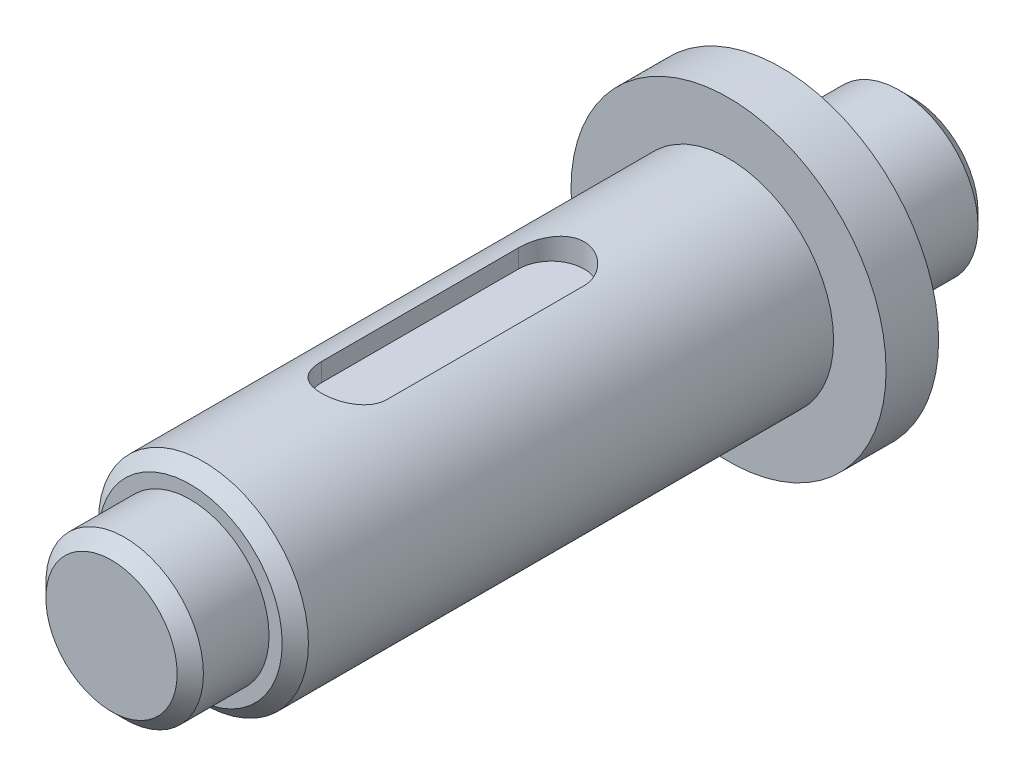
ISO-10303-21;
HEADER;
FILE_DESCRIPTION(('STEP AP214'),'2;1');
FILE_NAME('part.step','',(''),(''),'','','');
FILE_SCHEMA(('AUTOMOTIVE_DESIGN { 1 0 10303 214 1 1 1 1 }'));
ENDSEC;
DATA;
#1=APPLICATION_CONTEXT('core data for automotive mechanical design processes');
#2=APPLICATION_PROTOCOL_DEFINITION('international standard','automotive_design',2000,#1);
#3=PRODUCT_CONTEXT('',#1,'mechanical');
#4=PRODUCT('Part','Part','',(#3));
#5=PRODUCT_RELATED_PRODUCT_CATEGORY('part','',(#4));
#6=PRODUCT_DEFINITION_FORMATION('','',#4);
#7=PRODUCT_DEFINITION_CONTEXT('part definition',#1,'design');
#8=PRODUCT_DEFINITION('design','',#6,#7);
#9=PRODUCT_DEFINITION_SHAPE('','',#8);
#10=(LENGTH_UNIT() NAMED_UNIT(*) SI_UNIT(.MILLI.,.METRE.));
#11=(NAMED_UNIT(*) PLANE_ANGLE_UNIT() SI_UNIT($,.RADIAN.));
#12=(NAMED_UNIT(*) SI_UNIT($,.STERADIAN.) SOLID_ANGLE_UNIT());
#13=UNCERTAINTY_MEASURE_WITH_UNIT(LENGTH_MEASURE(1.E-05),#10,'distance_accuracy_value','');
#14=(GEOMETRIC_REPRESENTATION_CONTEXT(3) GLOBAL_UNCERTAINTY_ASSIGNED_CONTEXT((#13)) GLOBAL_UNIT_ASSIGNED_CONTEXT((#10,
#11,#12)) REPRESENTATION_CONTEXT('',''));
#15=CARTESIAN_POINT('',(0.,0.,0.));
#16=DIRECTION('',(0.,0.,1.));
#17=DIRECTION('',(1.,0.,0.));
#18=AXIS2_PLACEMENT_3D('',#15,#16,#17);
#19=CARTESIAN_POINT('',(0.,0.,55.));
#20=DIRECTION('',(0.,0.,-1.));
#21=DIRECTION('',(-1.,0.,0.));
#22=AXIS2_PLACEMENT_3D('',#19,#20,#21);
#23=CYLINDRICAL_SURFACE('',#22,8.);
#24=CARTESIAN_POINT('',(0.,0.,54.));
#25=DIRECTION('',(0.,0.,1.));
#26=DIRECTION('',(1.,0.,0.));
#27=AXIS2_PLACEMENT_3D('',#24,#25,#26);
#28=CIRCLE('',#27,8.);
#29=CARTESIAN_POINT('',(8.,0.,54.));
#30=VERTEX_POINT('',#29);
#31=EDGE_CURVE('E131',#30,#30,#28,.F.);
#32=ORIENTED_EDGE('',*,*,#31,.T.);
#33=EDGE_LOOP('',(#32));
#34=FACE_BOUND('',#33,.T.);
#35=CARTESIAN_POINT('',(0.,0.,14.));
#36=DIRECTION('',(0.,0.,1.));
#37=DIRECTION('',(1.,0.,0.));
#38=AXIS2_PLACEMENT_3D('',#35,#36,#37);
#39=CIRCLE('',#38,8.);
#40=CARTESIAN_POINT('',(8.,0.,14.));
#41=VERTEX_POINT('',#40);
#42=EDGE_CURVE('E115',#41,#41,#39,.T.);
#43=ORIENTED_EDGE('',*,*,#42,.T.);
#44=EDGE_LOOP('',(#43));
#45=FACE_BOUND('',#44,.T.);
#46=CARTESIAN_POINT('',(2.5,7.59934207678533,27.5));
#47=CARTESIAN_POINT('',(2.5000087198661,7.59933203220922,27.4315339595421));
#48=CARTESIAN_POINT('',(2.4971876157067,7.60026710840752,27.3630736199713));
#49=CARTESIAN_POINT('',(2.48595363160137,7.60395280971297,27.2266785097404));
#50=CARTESIAN_POINT('',(2.47754209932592,7.60670299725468,27.1587436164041));
#51=CARTESIAN_POINT('',(2.45522504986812,7.61393458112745,27.0240610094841));
#52=CARTESIAN_POINT('',(2.44133433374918,7.61841131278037,26.9573105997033));
#53=CARTESIAN_POINT('',(2.40819742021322,7.6289504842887,26.8252980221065));
#54=CARTESIAN_POINT('',(2.38895106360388,7.63501297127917,26.7600358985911));
#55=CARTESIAN_POINT('',(2.32342181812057,7.65531370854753,26.5672122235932));
#56=CARTESIAN_POINT('',(2.26931834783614,7.67167572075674,26.4424319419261));
#57=CARTESIAN_POINT('',(2.1419585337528,7.70820192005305,26.2037124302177));
#58=CARTESIAN_POINT('',(2.06869223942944,7.72836808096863,26.0897788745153));
#59=CARTESIAN_POINT('',(1.90239488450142,7.77100200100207,25.8720500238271));
#60=CARTESIAN_POINT('',(1.80882220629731,7.79352168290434,25.7686777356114));
#61=CARTESIAN_POINT('',(1.60572727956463,7.83788426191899,25.5788091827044));
#62=CARTESIAN_POINT('',(1.49620229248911,7.85972704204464,25.4923158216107));
#63=CARTESIAN_POINT('',(1.26124953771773,7.90087147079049,25.3367767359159));
#64=CARTESIAN_POINT('',(1.13551807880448,7.92010445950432,25.2681699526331));
#65=CARTESIAN_POINT('',(0.873602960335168,7.95325160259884,25.1532459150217));
#66=CARTESIAN_POINT('',(0.737422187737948,7.96716721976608,25.106922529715));
#67=CARTESIAN_POINT('',(0.462930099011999,7.98774341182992,25.0392981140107));
#68=CARTESIAN_POINT('',(0.324814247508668,7.99461464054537,25.0172689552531));
#69=CARTESIAN_POINT('',(0.0466844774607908,8.00107192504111,24.9965512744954));
#70=CARTESIAN_POINT('',(-0.0933290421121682,8.00065948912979,24.9978579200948));
#71=CARTESIAN_POINT('',(-0.366149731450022,7.99274230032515,25.0232966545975));
#72=CARTESIAN_POINT('',(-0.499038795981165,7.98548293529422,25.0466390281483));
#73=CARTESIAN_POINT('',(-0.758907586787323,7.96498949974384,25.1141904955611));
#74=CARTESIAN_POINT('',(-0.88588699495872,7.95175510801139,25.1584007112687));
#75=CARTESIAN_POINT('',(-1.13215685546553,7.92046911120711,25.2669406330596));
#76=CARTESIAN_POINT('',(-1.2513340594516,7.90236047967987,25.33151017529));
#77=CARTESIAN_POINT('',(-1.47740616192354,7.86323423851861,25.478743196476));
#78=CARTESIAN_POINT('',(-1.58429807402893,7.84221592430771,25.5614110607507));
#79=CARTESIAN_POINT('',(-1.78746586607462,7.79847545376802,25.7465381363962));
#80=CARTESIAN_POINT('',(-1.88311543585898,7.77571879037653,25.8496774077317));
#81=CARTESIAN_POINT('',(-2.05596538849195,7.73181622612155,26.0707703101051));
#82=CARTESIAN_POINT('',(-2.13316021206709,7.71067081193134,26.1887283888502));
#83=CARTESIAN_POINT('',(-2.26764925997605,7.67220528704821,26.4379029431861));
#84=CARTESIAN_POINT('',(-2.32470027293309,7.65493278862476,26.5692583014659));
#85=CARTESIAN_POINT('',(-2.41560912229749,7.62673815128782,26.8403118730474));
#86=CARTESIAN_POINT('',(-2.4495027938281,7.61580620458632,26.9799968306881));
#87=CARTESIAN_POINT('',(-2.48078343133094,7.60564225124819,27.1841751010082));
#88=CARTESIAN_POINT('',(-2.48798807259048,7.60328541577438,27.2471449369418));
#89=CARTESIAN_POINT('',(-2.49759244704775,7.60013482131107,27.3733989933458));
#90=CARTESIAN_POINT('',(-2.4999989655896,7.59933885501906,27.4366826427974));
#91=CARTESIAN_POINT('',(-2.5,7.59934207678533,27.5));
#92=B_SPLINE_CURVE_WITH_KNOTS('',3,(#46,#47,#48,#49,#50,#51,#52,#53,#54,#55,#56,#57,#58,#59,#60,
#61,#62,#63,#64,#65,#66,#67,#68,#69,#70,#71,#72,#73,#74,#75,#76,#77,#78,#79,#80,#81,#82,#83,#84,
#85,#86,#87,#88,#89,#90,#91),.UNSPECIFIED.,.F.,.F.,(4,2,2,2,2,2,2,2,2,2,2,2,2,2,2,2,2,2,2,2,2,2,
4),(0.,0.205323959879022,0.410598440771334,0.615322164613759,0.820051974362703,1.22896577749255,
1.63809233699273,2.05988351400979,2.48174718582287,2.91315381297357,3.34444167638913,
3.76241894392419,4.18030965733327,4.58377069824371,4.98725343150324,5.39567896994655,
5.80420358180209,6.22971654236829,6.6553575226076,7.08597472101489,7.51592403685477,
7.70602799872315,7.89586293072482),.UNSPECIFIED.);
#93=CARTESIAN_POINT('',(2.5,7.59934207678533,27.5));
#94=VERTEX_POINT('',#93);
#95=CARTESIAN_POINT('',(-2.5,7.59934207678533,27.5));
#96=VERTEX_POINT('',#95);
#97=EDGE_CURVE('E140',#94,#96,#92,.T.);
#98=ORIENTED_EDGE('',*,*,#97,.F.);
#99=DIRECTION('',(0.,0.,-1.));
#100=VECTOR('',#99,1.);
#101=CARTESIAN_POINT('',(2.5,7.59934207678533,55.));
#102=LINE('',#101,#100);
#103=CARTESIAN_POINT('',(2.5,7.59934207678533,42.5));
#104=VERTEX_POINT('',#103);
#105=EDGE_CURVE('E11',#104,#94,#102,.T.);
#106=ORIENTED_EDGE('',*,*,#105,.F.);
#107=CARTESIAN_POINT('',(-2.5,7.59934207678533,42.5));
#108=CARTESIAN_POINT('',(-2.5000087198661,7.59933203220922,42.5684660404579));
#109=CARTESIAN_POINT('',(-2.4971876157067,7.60026710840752,42.6369263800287));
#110=CARTESIAN_POINT('',(-2.48595363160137,7.60395280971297,42.7733214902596));
#111=CARTESIAN_POINT('',(-2.47754209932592,7.60670299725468,42.8412563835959));
#112=CARTESIAN_POINT('',(-2.45522504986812,7.61393458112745,42.9759389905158));
#113=CARTESIAN_POINT('',(-2.44133433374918,7.61841131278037,43.0426894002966));
#114=CARTESIAN_POINT('',(-2.40819742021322,7.6289504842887,43.1747019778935));
#115=CARTESIAN_POINT('',(-2.38895106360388,7.63501297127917,43.2399641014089));
#116=CARTESIAN_POINT('',(-2.32342181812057,7.65531370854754,43.4327877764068));
#117=CARTESIAN_POINT('',(-2.26931834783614,7.67167572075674,43.5575680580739));
#118=CARTESIAN_POINT('',(-2.1419585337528,7.70820192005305,43.7962875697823));
#119=CARTESIAN_POINT('',(-2.06869223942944,7.72836808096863,43.9102211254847));
#120=CARTESIAN_POINT('',(-1.90239488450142,7.77100200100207,44.1279499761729));
#121=CARTESIAN_POINT('',(-1.80882220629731,7.79352168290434,44.2313222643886));
#122=CARTESIAN_POINT('',(-1.60572727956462,7.83788426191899,44.4211908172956));
#123=CARTESIAN_POINT('',(-1.49620229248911,7.85972704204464,44.5076841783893));
#124=CARTESIAN_POINT('',(-1.26124953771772,7.90087147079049,44.6632232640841));
#125=CARTESIAN_POINT('',(-1.13551807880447,7.92010445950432,44.7318300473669));
#126=CARTESIAN_POINT('',(-0.873602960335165,7.95325160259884,44.8467540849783));
#127=CARTESIAN_POINT('',(-0.737422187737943,7.96716721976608,44.893077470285));
#128=CARTESIAN_POINT('',(-0.462930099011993,7.98774341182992,44.9607018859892));
#129=CARTESIAN_POINT('',(-0.324814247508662,7.99461464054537,44.9827310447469));
#130=CARTESIAN_POINT('',(-0.0466844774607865,8.00107192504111,45.0034487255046));
#131=CARTESIAN_POINT('',(0.0933290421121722,8.00065948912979,45.0021420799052));
#132=CARTESIAN_POINT('',(0.366149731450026,7.99274230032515,44.9767033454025));
#133=CARTESIAN_POINT('',(0.499038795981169,7.98548293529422,44.9533609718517));
#134=CARTESIAN_POINT('',(0.758907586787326,7.96498949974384,44.8858095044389));
#135=CARTESIAN_POINT('',(0.885886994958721,7.95175510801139,44.8415992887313));
#136=CARTESIAN_POINT('',(1.13215685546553,7.92046911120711,44.7330593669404));
#137=CARTESIAN_POINT('',(1.2513340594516,7.90236047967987,44.66848982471));
#138=CARTESIAN_POINT('',(1.47740616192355,7.86323423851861,44.521256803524));
#139=CARTESIAN_POINT('',(1.58429807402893,7.84221592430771,44.4385889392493));
#140=CARTESIAN_POINT('',(1.78746586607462,7.79847545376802,44.2534618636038));
#141=CARTESIAN_POINT('',(1.88311543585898,7.77571879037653,44.1503225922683));
#142=CARTESIAN_POINT('',(2.05596538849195,7.73181622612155,43.9292296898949));
#143=CARTESIAN_POINT('',(2.13316021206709,7.71067081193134,43.8112716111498));
#144=CARTESIAN_POINT('',(2.26764925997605,7.67220528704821,43.5620970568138));
#145=CARTESIAN_POINT('',(2.32470027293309,7.65493278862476,43.430741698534));
#146=CARTESIAN_POINT('',(2.41560912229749,7.62673815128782,43.1596881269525));
#147=CARTESIAN_POINT('',(2.4495027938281,7.61580620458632,43.0200031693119));
#148=CARTESIAN_POINT('',(2.48078343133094,7.60564225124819,42.8158248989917));
#149=CARTESIAN_POINT('',(2.48798807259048,7.60328541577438,42.7528550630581));
#150=CARTESIAN_POINT('',(2.49759244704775,7.60013482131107,42.6266010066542));
#151=CARTESIAN_POINT('',(2.4999989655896,7.59933885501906,42.5633173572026));
#152=CARTESIAN_POINT('',(2.5,7.59934207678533,42.5));
#153=B_SPLINE_CURVE_WITH_KNOTS('',3,(#107,#108,#109,#110,#111,#112,#113,#114,#115,#116,#117,
#118,#119,#120,#121,#122,#123,#124,#125,#126,#127,#128,#129,#130,#131,#132,#133,#134,#135,#136,
#137,#138,#139,#140,#141,#142,#143,#144,#145,#146,#147,#148,#149,#150,#151,#152),.UNSPECIFIED.,
.F.,.F.,(4,2,2,2,2,2,2,2,2,2,2,2,2,2,2,2,2,2,2,2,2,2,4),(0.,0.205323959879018,0.410598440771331,
0.615322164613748,0.820051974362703,1.22896577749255,1.63809233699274,2.05988351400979,
2.48174718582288,2.91315381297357,3.34444167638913,3.76241894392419,4.18030965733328,
4.58377069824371,4.98725343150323,5.39567896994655,5.80420358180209,6.22971654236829,
6.6553575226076,7.08597472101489,7.51592403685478,7.70602799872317,7.89586293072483),.UNSPECIFIED.);
#154=CARTESIAN_POINT('',(-2.5,7.59934207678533,42.5));
#155=VERTEX_POINT('',#154);
#156=EDGE_CURVE('E50',#155,#104,#153,.T.);
#157=ORIENTED_EDGE('',*,*,#156,.F.);
#158=DIRECTION('',(0.,0.,-1.));
#159=VECTOR('',#158,1.);
#160=CARTESIAN_POINT('',(-2.5,7.59934207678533,55.));
#161=LINE('',#160,#159);
#162=EDGE_CURVE('E100',#96,#155,#161,.F.);
#163=ORIENTED_EDGE('',*,*,#162,.F.);
#164=EDGE_LOOP('',(#98,#106,#157,#163));
#165=FACE_BOUND('',#164,.T.);
#166=ADVANCED_FACE('F41',(#34,#45,#165),#23,.T.);
#167=CARTESIAN_POINT('',(0.,0.,10.));
#168=DIRECTION('',(0.,0.,-1.));
#169=DIRECTION('',(-1.,0.,0.));
#170=AXIS2_PLACEMENT_3D('',#167,#168,#169);
#171=CYLINDRICAL_SURFACE('',#170,6.);
#172=CARTESIAN_POINT('',(0.,0.,1.00000000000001));
#173=DIRECTION('',(0.,0.,1.));
#174=DIRECTION('',(1.,0.,0.));
#175=AXIS2_PLACEMENT_3D('',#172,#173,#174);
#176=CIRCLE('',#175,6.);
#177=CARTESIAN_POINT('',(6.,0.,1.00000000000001));
#178=VERTEX_POINT('',#177);
#179=EDGE_CURVE('E114',#178,#178,#176,.T.);
#180=ORIENTED_EDGE('',*,*,#179,.T.);
#181=EDGE_LOOP('',(#180));
#182=FACE_BOUND('',#181,.T.);
#183=CARTESIAN_POINT('',(0.,0.,10.));
#184=DIRECTION('',(0.,0.,1.));
#185=DIRECTION('',(1.,0.,0.));
#186=AXIS2_PLACEMENT_3D('',#183,#184,#185);
#187=CIRCLE('',#186,6.);
#188=CARTESIAN_POINT('',(6.,0.,10.));
#189=VERTEX_POINT('',#188);
#190=EDGE_CURVE('E118',#189,#189,#187,.T.);
#191=ORIENTED_EDGE('',*,*,#190,.F.);
#192=EDGE_LOOP('',(#191));
#193=FACE_BOUND('',#192,.T.);
#194=ADVANCED_FACE('F181',(#182,#193),#171,.T.);
#195=CARTESIAN_POINT('',(0.,0.,0.));
#196=DIRECTION('',(0.,0.,1.));
#197=DIRECTION('',(1.,0.,0.));
#198=AXIS2_PLACEMENT_3D('',#195,#196,#197);
#199=PLANE('',#198);
#200=CARTESIAN_POINT('',(0.,0.,0.));
#201=DIRECTION('',(0.,0.,1.));
#202=DIRECTION('',(1.,0.,0.));
#203=AXIS2_PLACEMENT_3D('',#200,#201,#202);
#204=CIRCLE('',#203,4.99999999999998);
#205=CARTESIAN_POINT('',(4.99999999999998,0.,0.));
#206=VERTEX_POINT('',#205);
#207=EDGE_CURVE('E125',#206,#206,#204,.F.);
#208=ORIENTED_EDGE('',*,*,#207,.T.);
#209=EDGE_LOOP('',(#208));
#210=FACE_BOUND('',#209,.T.);
#211=ADVANCED_FACE('F186',(#210),#199,.F.);
#212=CARTESIAN_POINT('',(0.,0.,14.));
#213=DIRECTION('',(0.,0.,-1.));
#214=DIRECTION('',(-1.,0.,0.));
#215=AXIS2_PLACEMENT_3D('',#212,#213,#214);
#216=CYLINDRICAL_SURFACE('',#215,12.);
#217=CARTESIAN_POINT('',(0.,0.,14.));
#218=DIRECTION('',(0.,0.,1.));
#219=DIRECTION('',(1.,0.,0.));
#220=AXIS2_PLACEMENT_3D('',#217,#218,#219);
#221=CIRCLE('',#220,12.);
#222=CARTESIAN_POINT('',(12.,0.,14.));
#223=VERTEX_POINT('',#222);
#224=EDGE_CURVE('E105',#223,#223,#221,.T.);
#225=ORIENTED_EDGE('',*,*,#224,.F.);
#226=EDGE_LOOP('',(#225));
#227=FACE_BOUND('',#226,.T.);
#228=CARTESIAN_POINT('',(0.,0.,10.));
#229=DIRECTION('',(0.,0.,1.));
#230=DIRECTION('',(1.,0.,0.));
#231=AXIS2_PLACEMENT_3D('',#228,#229,#230);
#232=CIRCLE('',#231,12.);
#233=CARTESIAN_POINT('',(12.,0.,10.));
#234=VERTEX_POINT('',#233);
#235=EDGE_CURVE('E101',#234,#234,#232,.T.);
#236=ORIENTED_EDGE('',*,*,#235,.T.);
#237=EDGE_LOOP('',(#236));
#238=FACE_BOUND('',#237,.T.);
#239=ADVANCED_FACE('F197',(#227,#238),#216,.T.);
#240=CARTESIAN_POINT('',(0.,0.,14.));
#241=DIRECTION('',(0.,0.,1.));
#242=DIRECTION('',(1.,0.,0.));
#243=AXIS2_PLACEMENT_3D('',#240,#241,#242);
#244=PLANE('',#243);
#245=ORIENTED_EDGE('',*,*,#42,.F.);
#246=EDGE_LOOP('',(#245));
#247=FACE_BOUND('',#246,.T.);
#248=ORIENTED_EDGE('',*,*,#224,.T.);
#249=EDGE_LOOP('',(#248));
#250=FACE_BOUND('',#249,.T.);
#251=ADVANCED_FACE('F193',(#247,#250),#244,.T.);
#252=CARTESIAN_POINT('',(0.,0.,10.));
#253=DIRECTION('',(0.,0.,1.));
#254=DIRECTION('',(1.,0.,0.));
#255=AXIS2_PLACEMENT_3D('',#252,#253,#254);
#256=PLANE('',#255);
#257=ORIENTED_EDGE('',*,*,#190,.T.);
#258=EDGE_LOOP('',(#257));
#259=FACE_BOUND('',#258,.T.);
#260=ORIENTED_EDGE('',*,*,#235,.F.);
#261=EDGE_LOOP('',(#260));
#262=FACE_BOUND('',#261,.T.);
#263=ADVANCED_FACE('F196',(#259,#262),#256,.F.);
#264=CARTESIAN_POINT('',(0.,0.,55.));
#265=DIRECTION('',(0.,0.,1.));
#266=DIRECTION('',(1.,0.,0.));
#267=AXIS2_PLACEMENT_3D('',#264,#265,#266);
#268=PLANE('',#267);
#269=CARTESIAN_POINT('',(0.,0.,55.));
#270=DIRECTION('',(0.,0.,1.));
#271=DIRECTION('',(1.,0.,0.));
#272=AXIS2_PLACEMENT_3D('',#269,#270,#271);
#273=CIRCLE('',#272,7.);
#274=CARTESIAN_POINT('',(7.,0.,55.));
#275=VERTEX_POINT('',#274);
#276=EDGE_CURVE('E128',#275,#275,#273,.T.);
#277=ORIENTED_EDGE('',*,*,#276,.T.);
#278=EDGE_LOOP('',(#277));
#279=FACE_BOUND('',#278,.T.);
#280=CARTESIAN_POINT('',(0.,0.,55.));
#281=DIRECTION('',(0.,0.,1.));
#282=DIRECTION('',(1.,0.,0.));
#283=AXIS2_PLACEMENT_3D('',#280,#281,#282);
#284=CIRCLE('',#283,6.);
#285=CARTESIAN_POINT('',(6.,0.,55.));
#286=VERTEX_POINT('',#285);
#287=EDGE_CURVE('E111',#286,#286,#284,.T.);
#288=ORIENTED_EDGE('',*,*,#287,.F.);
#289=EDGE_LOOP('',(#288));
#290=FACE_BOUND('',#289,.T.);
#291=ADVANCED_FACE('F206',(#279,#290),#268,.T.);
#292=CARTESIAN_POINT('',(0.,0.,61.));
#293=DIRECTION('',(0.,0.,-1.));
#294=DIRECTION('',(-1.,0.,0.));
#295=AXIS2_PLACEMENT_3D('',#292,#293,#294);
#296=CYLINDRICAL_SURFACE('',#295,6.);
#297=CARTESIAN_POINT('',(0.,0.,60.));
#298=DIRECTION('',(0.,0.,1.));
#299=DIRECTION('',(1.,0.,0.));
#300=AXIS2_PLACEMENT_3D('',#297,#298,#299);
#301=CIRCLE('',#300,6.);
#302=CARTESIAN_POINT('',(6.,0.,60.));
#303=VERTEX_POINT('',#302);
#304=EDGE_CURVE('E137',#303,#303,#301,.F.);
#305=ORIENTED_EDGE('',*,*,#304,.T.);
#306=EDGE_LOOP('',(#305));
#307=FACE_BOUND('',#306,.T.);
#308=ORIENTED_EDGE('',*,*,#287,.T.);
#309=EDGE_LOOP('',(#308));
#310=FACE_BOUND('',#309,.T.);
#311=ADVANCED_FACE('F212',(#307,#310),#296,.T.);
#312=CARTESIAN_POINT('',(0.,0.,61.));
#313=DIRECTION('',(0.,0.,1.));
#314=DIRECTION('',(1.,0.,0.));
#315=AXIS2_PLACEMENT_3D('',#312,#313,#314);
#316=PLANE('',#315);
#317=CARTESIAN_POINT('',(0.,0.,61.));
#318=DIRECTION('',(0.,0.,1.));
#319=DIRECTION('',(1.,0.,0.));
#320=AXIS2_PLACEMENT_3D('',#317,#318,#319);
#321=CIRCLE('',#320,5.00000000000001);
#322=CARTESIAN_POINT('',(5.00000000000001,0.,61.));
#323=VERTEX_POINT('',#322);
#324=EDGE_CURVE('E134',#323,#323,#321,.T.);
#325=ORIENTED_EDGE('',*,*,#324,.T.);
#326=EDGE_LOOP('',(#325));
#327=FACE_BOUND('',#326,.T.);
#328=ADVANCED_FACE('F164',(#327),#316,.T.);
#329=CARTESIAN_POINT('',(0.,0.,1.00000000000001));
#330=DIRECTION('',(0.,0.,1.));
#331=DIRECTION('',(1.,0.,0.));
#332=AXIS2_PLACEMENT_3D('',#329,#330,#331);
#333=CONICAL_SURFACE('',#332,6.,0.785398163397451);
#334=ORIENTED_EDGE('',*,*,#207,.F.);
#335=EDGE_LOOP('',(#334));
#336=FACE_BOUND('',#335,.T.);
#337=ORIENTED_EDGE('',*,*,#179,.F.);
#338=EDGE_LOOP('',(#337));
#339=FACE_BOUND('',#338,.T.);
#340=ADVANCED_FACE('F219',(#336,#339),#333,.T.);
#341=CARTESIAN_POINT('',(0.,0.,55.));
#342=DIRECTION('',(0.,0.,-1.));
#343=DIRECTION('',(-1.,0.,0.));
#344=AXIS2_PLACEMENT_3D('',#341,#342,#343);
#345=CONICAL_SURFACE('',#344,7.,0.785398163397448);
#346=ORIENTED_EDGE('',*,*,#31,.F.);
#347=EDGE_LOOP('',(#346));
#348=FACE_BOUND('',#347,.T.);
#349=ORIENTED_EDGE('',*,*,#276,.F.);
#350=EDGE_LOOP('',(#349));
#351=FACE_BOUND('',#350,.T.);
#352=ADVANCED_FACE('F224',(#348,#351),#345,.T.);
#353=CARTESIAN_POINT('',(0.,0.,61.));
#354=DIRECTION('',(0.,0.,-1.));
#355=DIRECTION('',(-1.,0.,0.));
#356=AXIS2_PLACEMENT_3D('',#353,#354,#355);
#357=CONICAL_SURFACE('',#356,5.00000000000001,0.78539816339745);
#358=ORIENTED_EDGE('',*,*,#304,.F.);
#359=EDGE_LOOP('',(#358));
#360=FACE_BOUND('',#359,.T.);
#361=ORIENTED_EDGE('',*,*,#324,.F.);
#362=EDGE_LOOP('',(#361));
#363=FACE_BOUND('',#362,.T.);
#364=ADVANCED_FACE('F44',(#360,#363),#357,.T.);
#365=CARTESIAN_POINT('',(0.,6.20000000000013,42.5));
#366=DIRECTION('',(0.,1.,0.));
#367=DIRECTION('',(0.,0.,1.));
#368=AXIS2_PLACEMENT_3D('',#365,#366,#367);
#369=CYLINDRICAL_SURFACE('',#368,2.5);
#370=DIRECTION('',(0.,1.,0.));
#371=VECTOR('',#370,1.);
#372=CARTESIAN_POINT('',(-2.5,6.20000000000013,42.5));
#373=LINE('',#372,#371);
#374=CARTESIAN_POINT('',(-2.5,6.20000000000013,42.5));
#375=VERTEX_POINT('',#374);
#376=EDGE_CURVE('E97',#375,#155,#373,.T.);
#377=ORIENTED_EDGE('',*,*,#376,.T.);
#378=ORIENTED_EDGE('',*,*,#156,.T.);
#379=DIRECTION('',(0.,1.,0.));
#380=VECTOR('',#379,1.);
#381=CARTESIAN_POINT('',(2.5,6.20000000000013,42.5));
#382=LINE('',#381,#380);
#383=CARTESIAN_POINT('',(2.5,6.20000000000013,42.5));
#384=VERTEX_POINT('',#383);
#385=EDGE_CURVE('E56',#384,#104,#382,.T.);
#386=ORIENTED_EDGE('',*,*,#385,.F.);
#387=CARTESIAN_POINT('',(0.,6.20000000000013,42.5));
#388=DIRECTION('',(0.,-1.,0.));
#389=DIRECTION('',(0.,0.,1.));
#390=AXIS2_PLACEMENT_3D('',#387,#388,#389);
#391=CIRCLE('',#390,2.5);
#392=EDGE_CURVE('E87',#384,#375,#391,.T.);
#393=ORIENTED_EDGE('',*,*,#392,.T.);
#394=EDGE_LOOP('',(#377,#378,#386,#393));
#395=FACE_BOUND('',#394,.T.);
#396=ADVANCED_FACE('F96',(#395),#369,.F.);
#397=CARTESIAN_POINT('',(-2.5,6.20000000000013,42.5));
#398=DIRECTION('',(1.,0.,0.));
#399=DIRECTION('',(0.,0.,-1.));
#400=AXIS2_PLACEMENT_3D('',#397,#398,#399);
#401=PLANE('',#400);
#402=ORIENTED_EDGE('',*,*,#162,.T.);
#403=ORIENTED_EDGE('',*,*,#376,.F.);
#404=DIRECTION('',(0.,0.,-1.));
#405=VECTOR('',#404,1.);
#406=CARTESIAN_POINT('',(-2.5,6.20000000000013,42.5));
#407=LINE('',#406,#405);
#408=CARTESIAN_POINT('',(-2.5,6.20000000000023,27.5));
#409=VERTEX_POINT('',#408);
#410=EDGE_CURVE('E83',#375,#409,#407,.T.);
#411=ORIENTED_EDGE('',*,*,#410,.T.);
#412=DIRECTION('',(0.,1.,0.));
#413=VECTOR('',#412,1.);
#414=CARTESIAN_POINT('',(-2.5,6.20000000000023,27.5));
#415=LINE('',#414,#413);
#416=EDGE_CURVE('E102',#409,#96,#415,.T.);
#417=ORIENTED_EDGE('',*,*,#416,.T.);
#418=EDGE_LOOP('',(#402,#403,#411,#417));
#419=FACE_BOUND('',#418,.T.);
#420=ADVANCED_FACE('F99',(#419),#401,.T.);
#421=CARTESIAN_POINT('',(0.,6.20000000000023,27.5));
#422=DIRECTION('',(0.,1.,0.));
#423=DIRECTION('',(0.,0.,1.));
#424=AXIS2_PLACEMENT_3D('',#421,#422,#423);
#425=CYLINDRICAL_SURFACE('',#424,2.5);
#426=DIRECTION('',(0.,1.,0.));
#427=VECTOR('',#426,1.);
#428=CARTESIAN_POINT('',(2.5,6.20000000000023,27.5));
#429=LINE('',#428,#427);
#430=CARTESIAN_POINT('',(2.5,6.20000000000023,27.5));
#431=VERTEX_POINT('',#430);
#432=EDGE_CURVE('E107',#431,#94,#429,.T.);
#433=ORIENTED_EDGE('',*,*,#432,.T.);
#434=ORIENTED_EDGE('',*,*,#97,.T.);
#435=ORIENTED_EDGE('',*,*,#416,.F.);
#436=CARTESIAN_POINT('',(0.,6.20000000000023,27.5));
#437=DIRECTION('',(0.,-1.,0.));
#438=DIRECTION('',(0.,0.,-1.));
#439=AXIS2_PLACEMENT_3D('',#436,#437,#438);
#440=CIRCLE('',#439,2.5);
#441=EDGE_CURVE('E88',#409,#431,#440,.T.);
#442=ORIENTED_EDGE('',*,*,#441,.T.);
#443=EDGE_LOOP('',(#433,#434,#435,#442));
#444=FACE_BOUND('',#443,.T.);
#445=ADVANCED_FACE('F151',(#444),#425,.F.);
#446=CARTESIAN_POINT('',(2.5,6.20000000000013,42.5));
#447=DIRECTION('',(-1.,0.,0.));
#448=DIRECTION('',(0.,0.,1.));
#449=AXIS2_PLACEMENT_3D('',#446,#447,#448);
#450=PLANE('',#449);
#451=ORIENTED_EDGE('',*,*,#105,.T.);
#452=ORIENTED_EDGE('',*,*,#432,.F.);
#453=DIRECTION('',(0.,0.,1.));
#454=VECTOR('',#453,1.);
#455=CARTESIAN_POINT('',(2.5,6.20000000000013,42.5));
#456=LINE('',#455,#454);
#457=EDGE_CURVE('E172',#431,#384,#456,.T.);
#458=ORIENTED_EDGE('',*,*,#457,.T.);
#459=ORIENTED_EDGE('',*,*,#385,.T.);
#460=EDGE_LOOP('',(#451,#452,#458,#459));
#461=FACE_BOUND('',#460,.T.);
#462=ADVANCED_FACE('F156',(#461),#450,.T.);
#463=CARTESIAN_POINT('',(0.,6.20000000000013,42.5));
#464=DIRECTION('',(0.,1.,0.));
#465=DIRECTION('',(0.,0.,1.));
#466=AXIS2_PLACEMENT_3D('',#463,#464,#465);
#467=PLANE('',#466);
#468=ORIENTED_EDGE('',*,*,#392,.F.);
#469=ORIENTED_EDGE('',*,*,#457,.F.);
#470=ORIENTED_EDGE('',*,*,#441,.F.);
#471=ORIENTED_EDGE('',*,*,#410,.F.);
#472=EDGE_LOOP('',(#468,#469,#470,#471));
#473=FACE_BOUND('',#472,.T.);
#474=ADVANCED_FACE('F85',(#473),#467,.T.);
#475=CLOSED_SHELL('',(#166,#194,#211,#239,#251,#263,#291,#311,#328,#340,#352,#364,#396,#420,
#445,#462,#474));
#476=MANIFOLD_SOLID_BREP('B2',#475);
#477=ADVANCED_BREP_SHAPE_REPRESENTATION('',(#18,#476),#14);
#478=SHAPE_DEFINITION_REPRESENTATION(#9,#477);
ENDSEC;
END-ISO-10303-21;
